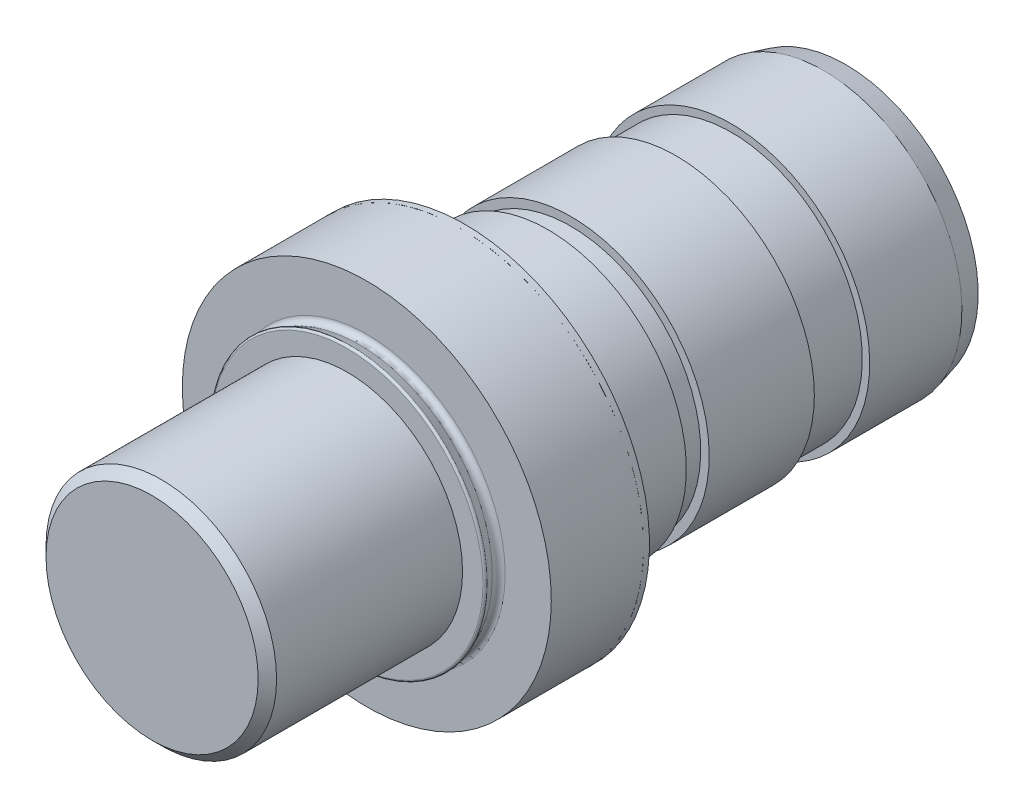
ISO-10303-21;
HEADER;
FILE_DESCRIPTION(('STEP AP214'),'2;1');
FILE_NAME('part.step','',(''),(''),'','','');
FILE_SCHEMA(('AUTOMOTIVE_DESIGN { 1 0 10303 214 1 1 1 1 }'));
ENDSEC;
DATA;
#1=APPLICATION_CONTEXT('core data for automotive mechanical design processes');
#2=APPLICATION_PROTOCOL_DEFINITION('international standard','automotive_design',2000,#1);
#3=PRODUCT_CONTEXT('',#1,'mechanical');
#4=PRODUCT('Part','Part','',(#3));
#5=PRODUCT_RELATED_PRODUCT_CATEGORY('part','',(#4));
#6=PRODUCT_DEFINITION_FORMATION('','',#4);
#7=PRODUCT_DEFINITION_CONTEXT('part definition',#1,'design');
#8=PRODUCT_DEFINITION('design','',#6,#7);
#9=PRODUCT_DEFINITION_SHAPE('','',#8);
#10=(LENGTH_UNIT() NAMED_UNIT(*) SI_UNIT(.MILLI.,.METRE.));
#11=(NAMED_UNIT(*) PLANE_ANGLE_UNIT() SI_UNIT($,.RADIAN.));
#12=(NAMED_UNIT(*) SI_UNIT($,.STERADIAN.) SOLID_ANGLE_UNIT());
#13=UNCERTAINTY_MEASURE_WITH_UNIT(LENGTH_MEASURE(1.E-05),#10,'distance_accuracy_value','');
#14=(GEOMETRIC_REPRESENTATION_CONTEXT(3) GLOBAL_UNCERTAINTY_ASSIGNED_CONTEXT((#13)) GLOBAL_UNIT_ASSIGNED_CONTEXT((#10,
#11,#12)) REPRESENTATION_CONTEXT('',''));
#15=CARTESIAN_POINT('',(0.,0.,0.));
#16=DIRECTION('',(0.,0.,1.));
#17=DIRECTION('',(1.,0.,0.));
#18=AXIS2_PLACEMENT_3D('',#15,#16,#17);
#19=CARTESIAN_POINT('',(9.1186,-9.1186,0.));
#20=DIRECTION('',(0.,0.,-1.));
#21=DIRECTION('',(-1.,0.,0.));
#22=AXIS2_PLACEMENT_3D('',#19,#20,#21);
#23=PLANE('',#22);
#24=CARTESIAN_POINT('',(0.,0.,0.));
#25=DIRECTION('',(0.,0.,-1.));
#26=DIRECTION('',(0.,1.,0.));
#27=AXIS2_PLACEMENT_3D('',#24,#25,#26);
#28=CIRCLE('',#27,9.1186);
#29=CARTESIAN_POINT('',(0.,9.1186,0.));
#30=VERTEX_POINT('',#29);
#31=EDGE_CURVE('E133',#30,#30,#28,.F.);
#32=ORIENTED_EDGE('',*,*,#31,.F.);
#33=EDGE_LOOP('',(#32));
#34=FACE_BOUND('',#33,.T.);
#35=ADVANCED_FACE('F15',(#34),#23,.T.);
#36=CARTESIAN_POINT('',(-7.3025,-8.08428384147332,47.752));
#37=DIRECTION('',(0.,0.,1.));
#38=DIRECTION('',(1.,0.,0.));
#39=AXIS2_PLACEMENT_3D('',#36,#37,#38);
#40=PLANE('',#39);
#41=CARTESIAN_POINT('',(0.,0.,47.752));
#42=DIRECTION('',(0.,0.,1.));
#43=DIRECTION('',(1.,0.,0.));
#44=AXIS2_PLACEMENT_3D('',#41,#42,#43);
#45=CIRCLE('',#44,7.30250000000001);
#46=CARTESIAN_POINT('',(7.30250000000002,0.,47.752));
#47=VERTEX_POINT('',#46);
#48=EDGE_CURVE('E129',#47,#47,#45,.F.);
#49=ORIENTED_EDGE('',*,*,#48,.F.);
#50=EDGE_LOOP('',(#49));
#51=FACE_BOUND('',#50,.T.);
#52=ADVANCED_FACE('F142',(#51),#40,.T.);
#53=CARTESIAN_POINT('',(0.,0.,1.52400000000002));
#54=DIRECTION('',(0.,0.,1.));
#55=DIRECTION('',(0.,-1.,0.));
#56=AXIS2_PLACEMENT_3D('',#53,#54,#55);
#57=CONICAL_SURFACE('',#56,9.525,0.260602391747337);
#58=ORIENTED_EDGE('',*,*,#31,.T.);
#59=EDGE_LOOP('',(#58));
#60=FACE_BOUND('',#59,.T.);
#61=CARTESIAN_POINT('',(0.,0.,1.52400000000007));
#62=DIRECTION('',(0.,0.,1.));
#63=DIRECTION('',(0.,-1.,0.));
#64=AXIS2_PLACEMENT_3D('',#61,#62,#63);
#65=CIRCLE('',#64,9.52500000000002);
#66=CARTESIAN_POINT('',(0.,-9.52500000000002,1.52400000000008));
#67=VERTEX_POINT('',#66);
#68=EDGE_CURVE('E126',#67,#67,#65,.T.);
#69=ORIENTED_EDGE('',*,*,#68,.F.);
#70=EDGE_LOOP('',(#69));
#71=FACE_BOUND('',#70,.T.);
#72=ADVANCED_FACE('F138',(#60,#71),#57,.T.);
#73=CARTESIAN_POINT('',(0.,0.,47.117));
#74=DIRECTION('',(0.,0.,-1.));
#75=DIRECTION('',(-1.,0.,0.));
#76=AXIS2_PLACEMENT_3D('',#73,#74,#75);
#77=CONICAL_SURFACE('',#76,7.93750000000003,0.785398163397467);
#78=ORIENTED_EDGE('',*,*,#48,.T.);
#79=EDGE_LOOP('',(#78));
#80=FACE_BOUND('',#79,.T.);
#81=CARTESIAN_POINT('',(0.,0.,47.117));
#82=DIRECTION('',(0.,0.,-1.));
#83=DIRECTION('',(-1.,0.,0.));
#84=AXIS2_PLACEMENT_3D('',#81,#82,#83);
#85=CIRCLE('',#84,7.9375);
#86=CARTESIAN_POINT('',(-7.9375,0.,47.117));
#87=VERTEX_POINT('',#86);
#88=EDGE_CURVE('E122',#87,#87,#85,.T.);
#89=ORIENTED_EDGE('',*,*,#88,.F.);
#90=EDGE_LOOP('',(#89));
#91=FACE_BOUND('',#90,.T.);
#92=ADVANCED_FACE('F152',(#80,#91),#77,.T.);
#93=CARTESIAN_POINT('',(0.,0.,1.524));
#94=DIRECTION('',(0.,0.,1.));
#95=DIRECTION('',(0.,-1.,0.));
#96=AXIS2_PLACEMENT_3D('',#93,#94,#95);
#97=CYLINDRICAL_SURFACE('',#96,9.52500000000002);
#98=CARTESIAN_POINT('',(0.,0.,7.874));
#99=DIRECTION('',(0.,0.,1.));
#100=DIRECTION('',(0.,-1.,0.));
#101=AXIS2_PLACEMENT_3D('',#98,#99,#100);
#102=CIRCLE('',#101,9.52500000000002);
#103=CARTESIAN_POINT('',(0.,-9.52500000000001,7.87400000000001));
#104=VERTEX_POINT('',#103);
#105=EDGE_CURVE('E118',#104,#104,#102,.T.);
#106=ORIENTED_EDGE('',*,*,#105,.F.);
#107=EDGE_LOOP('',(#106));
#108=FACE_BOUND('',#107,.T.);
#109=ORIENTED_EDGE('',*,*,#68,.T.);
#110=EDGE_LOOP('',(#109));
#111=FACE_BOUND('',#110,.T.);
#112=ADVANCED_FACE('F155',(#108,#111),#97,.T.);
#113=CARTESIAN_POINT('',(0.,0.,47.117));
#114=DIRECTION('',(0.,0.,-1.));
#115=DIRECTION('',(0.,1.,0.));
#116=AXIS2_PLACEMENT_3D('',#113,#114,#115);
#117=CYLINDRICAL_SURFACE('',#116,7.9375);
#118=CARTESIAN_POINT('',(0.,0.,34.3154));
#119=DIRECTION('',(0.,0.,1.));
#120=DIRECTION('',(1.,0.,0.));
#121=AXIS2_PLACEMENT_3D('',#118,#119,#120);
#122=CIRCLE('',#121,7.9375);
#123=CARTESIAN_POINT('',(7.93749999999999,0.,34.3154));
#124=VERTEX_POINT('',#123);
#125=EDGE_CURVE('E115',#124,#124,#122,.F.);
#126=ORIENTED_EDGE('',*,*,#125,.F.);
#127=EDGE_LOOP('',(#126));
#128=FACE_BOUND('',#127,.T.);
#129=ORIENTED_EDGE('',*,*,#88,.T.);
#130=EDGE_LOOP('',(#129));
#131=FACE_BOUND('',#130,.T.);
#132=ADVANCED_FACE('F159',(#128,#131),#117,.T.);
#133=CARTESIAN_POINT('',(-10.5520800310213,-10.5447180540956,7.87400000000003));
#134=DIRECTION('',(0.,0.,1.));
#135=DIRECTION('',(1.,0.,0.));
#136=AXIS2_PLACEMENT_3D('',#133,#134,#135);
#137=PLANE('',#136);
#138=CARTESIAN_POINT('',(0.,0.,7.874));
#139=DIRECTION('',(0.,0.,1.));
#140=DIRECTION('',(0.,-1.,0.));
#141=AXIS2_PLACEMENT_3D('',#138,#139,#140);
#142=CIRCLE('',#141,9.017);
#143=CARTESIAN_POINT('',(0.,-9.01699999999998,7.87400000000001));
#144=VERTEX_POINT('',#143);
#145=EDGE_CURVE('E111',#144,#144,#142,.T.);
#146=ORIENTED_EDGE('',*,*,#145,.F.);
#147=EDGE_LOOP('',(#146));
#148=FACE_BOUND('',#147,.T.);
#149=ORIENTED_EDGE('',*,*,#105,.T.);
#150=EDGE_LOOP('',(#149));
#151=FACE_BOUND('',#150,.T.);
#152=ADVANCED_FACE('F163',(#148,#151),#137,.T.);
#153=CARTESIAN_POINT('',(-9.34213714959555,-10.342278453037,34.3154));
#154=DIRECTION('',(0.,0.,1.));
#155=DIRECTION('',(1.,0.,0.));
#156=AXIS2_PLACEMENT_3D('',#153,#154,#155);
#157=PLANE('',#156);
#158=ORIENTED_EDGE('',*,*,#125,.T.);
#159=EDGE_LOOP('',(#158));
#160=FACE_BOUND('',#159,.T.);
#161=CARTESIAN_POINT('',(0.,0.,34.3154));
#162=DIRECTION('',(0.,0.,1.));
#163=DIRECTION('',(1.,0.,0.));
#164=AXIS2_PLACEMENT_3D('',#161,#162,#163);
#165=CIRCLE('',#164,9.34213714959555);
#166=CARTESIAN_POINT('',(9.34213714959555,0.,34.3154));
#167=VERTEX_POINT('',#166);
#168=EDGE_CURVE('E107',#167,#167,#165,.F.);
#169=ORIENTED_EDGE('',*,*,#168,.F.);
#170=EDGE_LOOP('',(#169));
#171=FACE_BOUND('',#170,.T.);
#172=ADVANCED_FACE('F167',(#160,#171),#157,.T.);
#173=CARTESIAN_POINT('',(0.,0.,11.684));
#174=DIRECTION('',(0.,0.,-1.));
#175=DIRECTION('',(-1.,0.,0.));
#176=AXIS2_PLACEMENT_3D('',#173,#174,#175);
#177=CYLINDRICAL_SURFACE('',#176,9.017);
#178=ORIENTED_EDGE('',*,*,#145,.T.);
#179=EDGE_LOOP('',(#178));
#180=FACE_BOUND('',#179,.T.);
#181=CARTESIAN_POINT('',(0.,0.,11.684));
#182=DIRECTION('',(0.,0.,-1.));
#183=DIRECTION('',(-1.,0.,0.));
#184=AXIS2_PLACEMENT_3D('',#181,#182,#183);
#185=CIRCLE('',#184,9.017);
#186=CARTESIAN_POINT('',(-9.017,0.,11.684));
#187=VERTEX_POINT('',#186);
#188=EDGE_CURVE('E103',#187,#187,#185,.F.);
#189=ORIENTED_EDGE('',*,*,#188,.F.);
#190=EDGE_LOOP('',(#189));
#191=FACE_BOUND('',#190,.T.);
#192=ADVANCED_FACE('F171',(#180,#191),#177,.T.);
#193=CARTESIAN_POINT('',(9.525,-10.5447180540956,11.684));
#194=DIRECTION('',(0.,0.,-1.));
#195=DIRECTION('',(-1.,0.,0.));
#196=AXIS2_PLACEMENT_3D('',#193,#194,#195);
#197=PLANE('',#196);
#198=ORIENTED_EDGE('',*,*,#188,.T.);
#199=EDGE_LOOP('',(#198));
#200=FACE_BOUND('',#199,.T.);
#201=CARTESIAN_POINT('',(0.,0.,11.684));
#202=DIRECTION('',(0.,0.,-1.));
#203=DIRECTION('',(-1.,0.,0.));
#204=AXIS2_PLACEMENT_3D('',#201,#202,#203);
#205=CIRCLE('',#204,9.525);
#206=CARTESIAN_POINT('',(-9.525,0.,11.684));
#207=VERTEX_POINT('',#206);
#208=EDGE_CURVE('E99',#207,#207,#205,.F.);
#209=ORIENTED_EDGE('',*,*,#208,.F.);
#210=EDGE_LOOP('',(#209));
#211=FACE_BOUND('',#210,.T.);
#212=ADVANCED_FACE('F175',(#200,#211),#197,.T.);
#213=CARTESIAN_POINT('',(0.,0.,34.1884));
#214=DIRECTION('',(0.,0.,1.));
#215=DIRECTION('',(1.,0.,0.));
#216=AXIS2_PLACEMENT_3D('',#213,#214,#215);
#217=TOROIDAL_SURFACE('',#216,9.34213714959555,0.127);
#218=ORIENTED_EDGE('',*,*,#168,.T.);
#219=EDGE_LOOP('',(#218));
#220=FACE_BOUND('',#219,.T.);
#221=CARTESIAN_POINT('',(0.,0.,34.1367444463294));
#222=DIRECTION('',(0.,0.,1.));
#223=DIRECTION('',(1.,0.,0.));
#224=AXIS2_PLACEMENT_3D('',#221,#222,#223);
#225=CIRCLE('',#224,9.45815742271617);
#226=CARTESIAN_POINT('',(9.45815742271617,0.,34.1367444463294));
#227=VERTEX_POINT('',#226);
#228=EDGE_CURVE('E96',#227,#227,#225,.F.);
#229=ORIENTED_EDGE('',*,*,#228,.F.);
#230=EDGE_LOOP('',(#229));
#231=FACE_BOUND('',#230,.T.);
#232=ADVANCED_FACE('F179',(#220,#231),#217,.T.);
#233=CARTESIAN_POINT('',(0.,0.,11.684));
#234=DIRECTION('',(0.,0.,1.));
#235=DIRECTION('',(0.,-1.,0.));
#236=AXIS2_PLACEMENT_3D('',#233,#234,#235);
#237=CYLINDRICAL_SURFACE('',#236,9.525);
#238=CARTESIAN_POINT('',(0.,0.,18.923));
#239=DIRECTION('',(0.,0.,1.));
#240=DIRECTION('',(0.,-1.,0.));
#241=AXIS2_PLACEMENT_3D('',#238,#239,#240);
#242=CIRCLE('',#241,9.525);
#243=CARTESIAN_POINT('',(0.,-9.52499999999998,18.923));
#244=VERTEX_POINT('',#243);
#245=EDGE_CURVE('E93',#244,#244,#242,.T.);
#246=ORIENTED_EDGE('',*,*,#245,.F.);
#247=EDGE_LOOP('',(#246));
#248=FACE_BOUND('',#247,.T.);
#249=ORIENTED_EDGE('',*,*,#208,.T.);
#250=EDGE_LOOP('',(#249));
#251=FACE_BOUND('',#250,.T.);
#252=ADVANCED_FACE('F183',(#248,#251),#237,.T.);
#253=CARTESIAN_POINT('',(0.,0.,34.1367444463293));
#254=DIRECTION('',(0.,0.,1.));
#255=DIRECTION('',(1.,0.,0.));
#256=AXIS2_PLACEMENT_3D('',#253,#254,#255);
#257=CONICAL_SURFACE('',#256,9.45815742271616,0.418879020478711);
#258=ORIENTED_EDGE('',*,*,#228,.T.);
#259=EDGE_LOOP('',(#258));
#260=FACE_BOUND('',#259,.T.);
#261=CARTESIAN_POINT('',(0.,0.,33.5051666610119));
#262=DIRECTION('',(0.,0.,1.));
#263=DIRECTION('',(1.,0.,0.));
#264=AXIS2_PLACEMENT_3D('',#261,#262,#263);
#265=CIRCLE('',#264,9.17696087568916);
#266=CARTESIAN_POINT('',(9.17696087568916,0.,33.5051666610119));
#267=VERTEX_POINT('',#266);
#268=EDGE_CURVE('E90',#267,#267,#265,.F.);
#269=ORIENTED_EDGE('',*,*,#268,.F.);
#270=EDGE_LOOP('',(#269));
#271=FACE_BOUND('',#270,.T.);
#272=ADVANCED_FACE('F187',(#260,#271),#257,.T.);
#273=CARTESIAN_POINT('',(-10.5520800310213,-10.5447180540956,18.923));
#274=DIRECTION('',(0.,0.,1.));
#275=DIRECTION('',(1.,0.,0.));
#276=AXIS2_PLACEMENT_3D('',#273,#274,#275);
#277=PLANE('',#276);
#278=CARTESIAN_POINT('',(0.,0.,18.923));
#279=DIRECTION('',(0.,0.,1.));
#280=DIRECTION('',(0.,-1.,0.));
#281=AXIS2_PLACEMENT_3D('',#278,#279,#280);
#282=CIRCLE('',#281,8.9408);
#283=CARTESIAN_POINT('',(0.,-8.94079999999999,18.923));
#284=VERTEX_POINT('',#283);
#285=EDGE_CURVE('E87',#284,#284,#282,.T.);
#286=ORIENTED_EDGE('',*,*,#285,.F.);
#287=EDGE_LOOP('',(#286));
#288=FACE_BOUND('',#287,.T.);
#289=ORIENTED_EDGE('',*,*,#245,.T.);
#290=EDGE_LOOP('',(#289));
#291=FACE_BOUND('',#290,.T.);
#292=ADVANCED_FACE('F191',(#288,#291),#277,.T.);
#293=CARTESIAN_POINT('',(0.,0.,20.4978));
#294=DIRECTION('',(0.,0.,-1.));
#295=DIRECTION('',(0.,1.,0.));
#296=AXIS2_PLACEMENT_3D('',#293,#294,#295);
#297=CYLINDRICAL_SURFACE('',#296,8.9408);
#298=ORIENTED_EDGE('',*,*,#285,.T.);
#299=EDGE_LOOP('',(#298));
#300=FACE_BOUND('',#299,.T.);
#301=CARTESIAN_POINT('',(0.,0.,20.4978));
#302=DIRECTION('',(0.,0.,-1.));
#303=DIRECTION('',(-1.,0.,0.));
#304=AXIS2_PLACEMENT_3D('',#301,#302,#303);
#305=CIRCLE('',#304,8.9408);
#306=CARTESIAN_POINT('',(-8.9408,0.,20.4978));
#307=VERTEX_POINT('',#306);
#308=EDGE_CURVE('E84',#307,#307,#305,.F.);
#309=ORIENTED_EDGE('',*,*,#308,.F.);
#310=EDGE_LOOP('',(#309));
#311=FACE_BOUND('',#310,.T.);
#312=ADVANCED_FACE('F195',(#300,#311),#297,.T.);
#313=CARTESIAN_POINT('',(0.,0.,33.3502));
#314=DIRECTION('',(0.,0.,1.));
#315=DIRECTION('',(1.,0.,0.));
#316=AXIS2_PLACEMENT_3D('',#313,#314,#315);
#317=TOROIDAL_SURFACE('',#316,9.525021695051,0.381);
#318=ORIENTED_EDGE('',*,*,#268,.T.);
#319=EDGE_LOOP('',(#318));
#320=FACE_BOUND('',#319,.T.);
#321=CARTESIAN_POINT('',(0.,0.,32.9692));
#322=DIRECTION('',(0.,0.,1.));
#323=DIRECTION('',(1.,0.,0.));
#324=AXIS2_PLACEMENT_3D('',#321,#322,#323);
#325=CIRCLE('',#324,9.525021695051);
#326=CARTESIAN_POINT('',(9.525021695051,0.,32.9692));
#327=VERTEX_POINT('',#326);
#328=EDGE_CURVE('E79',#327,#327,#325,.F.);
#329=ORIENTED_EDGE('',*,*,#328,.F.);
#330=EDGE_LOOP('',(#329));
#331=FACE_BOUND('',#330,.T.);
#332=ADVANCED_FACE('F199',(#320,#331),#317,.F.);
#333=CARTESIAN_POINT('',(9.525,-10.5447180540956,20.4978));
#334=DIRECTION('',(0.,0.,-1.));
#335=DIRECTION('',(-1.,0.,0.));
#336=AXIS2_PLACEMENT_3D('',#333,#334,#335);
#337=PLANE('',#336);
#338=ORIENTED_EDGE('',*,*,#308,.T.);
#339=EDGE_LOOP('',(#338));
#340=FACE_BOUND('',#339,.T.);
#341=CARTESIAN_POINT('',(0.,0.,20.4978));
#342=DIRECTION('',(0.,0.,-1.));
#343=DIRECTION('',(-1.,0.,0.));
#344=AXIS2_PLACEMENT_3D('',#341,#342,#343);
#345=CIRCLE('',#344,9.525);
#346=CARTESIAN_POINT('',(-9.525,0.,20.4978));
#347=VERTEX_POINT('',#346);
#348=EDGE_CURVE('E74',#347,#347,#345,.F.);
#349=ORIENTED_EDGE('',*,*,#348,.F.);
#350=EDGE_LOOP('',(#349));
#351=FACE_BOUND('',#350,.T.);
#352=ADVANCED_FACE('F203',(#340,#351),#337,.T.);
#353=CARTESIAN_POINT('',(-12.7,-12.7,32.9692));
#354=DIRECTION('',(0.,0.,1.));
#355=DIRECTION('',(1.,0.,0.));
#356=AXIS2_PLACEMENT_3D('',#353,#354,#355);
#357=PLANE('',#356);
#358=ORIENTED_EDGE('',*,*,#328,.T.);
#359=EDGE_LOOP('',(#358));
#360=FACE_BOUND('',#359,.T.);
#361=CARTESIAN_POINT('',(0.,0.,32.9692));
#362=DIRECTION('',(0.,0.,1.));
#363=DIRECTION('',(1.,0.,0.));
#364=AXIS2_PLACEMENT_3D('',#361,#362,#363);
#365=CIRCLE('',#364,12.7);
#366=CARTESIAN_POINT('',(12.7,0.,32.9692));
#367=VERTEX_POINT('',#366);
#368=EDGE_CURVE('E71',#367,#367,#365,.F.);
#369=ORIENTED_EDGE('',*,*,#368,.F.);
#370=EDGE_LOOP('',(#369));
#371=FACE_BOUND('',#370,.T.);
#372=ADVANCED_FACE('F207',(#360,#371),#357,.T.);
#373=CARTESIAN_POINT('',(0.,0.,20.4978));
#374=DIRECTION('',(0.,0.,1.));
#375=DIRECTION('',(1.,0.,0.));
#376=AXIS2_PLACEMENT_3D('',#373,#374,#375);
#377=CYLINDRICAL_SURFACE('',#376,9.525);
#378=ORIENTED_EDGE('',*,*,#348,.T.);
#379=EDGE_LOOP('',(#378));
#380=FACE_BOUND('',#379,.T.);
#381=CARTESIAN_POINT('',(0.,0.,26.6192));
#382=DIRECTION('',(0.,0.,-1.));
#383=DIRECTION('',(-1.,0.,0.));
#384=AXIS2_PLACEMENT_3D('',#381,#382,#383);
#385=CIRCLE('',#384,9.525);
#386=CARTESIAN_POINT('',(-9.525,0.,26.6192));
#387=VERTEX_POINT('',#386);
#388=EDGE_CURVE('E36',#387,#387,#385,.F.);
#389=ORIENTED_EDGE('',*,*,#388,.F.);
#390=EDGE_LOOP('',(#389));
#391=FACE_BOUND('',#390,.T.);
#392=ADVANCED_FACE('F67',(#380,#391),#377,.T.);
#393=CARTESIAN_POINT('',(12.7,-12.7,26.6192));
#394=DIRECTION('',(0.,0.,-1.));
#395=DIRECTION('',(-1.,0.,0.));
#396=AXIS2_PLACEMENT_3D('',#393,#394,#395);
#397=PLANE('',#396);
#398=ORIENTED_EDGE('',*,*,#388,.T.);
#399=EDGE_LOOP('',(#398));
#400=FACE_BOUND('',#399,.T.);
#401=CARTESIAN_POINT('',(12.7,0.,26.6192));
#402=CARTESIAN_POINT('',(12.7000141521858,0.211419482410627,26.6192));
#403=CARTESIAN_POINT('',(12.6950749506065,0.422854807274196,26.6192));
#404=CARTESIAN_POINT('',(12.6751203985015,0.843046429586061,26.6192));
#405=CARTESIAN_POINT('',(12.6602101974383,1.05180774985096,26.6192));
#406=CARTESIAN_POINT('',(12.620317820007,1.46665555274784,26.6192));
#407=CARTESIAN_POINT('',(12.5954186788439,1.67274997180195,26.6192));
#408=CARTESIAN_POINT('',(12.5355760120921,2.08225891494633,26.6192));
#409=CARTESIAN_POINT('',(12.5006914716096,2.28568204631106,26.6192));
#410=CARTESIAN_POINT('',(12.4209015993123,2.68984882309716,26.6192));
#411=CARTESIAN_POINT('',(12.3760301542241,2.89059915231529,26.6192));
#412=CARTESIAN_POINT('',(12.2762922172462,3.28942246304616,26.6192));
#413=CARTESIAN_POINT('',(12.2214341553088,3.48749755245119,26.6192));
#414=CARTESIAN_POINT('',(12.1017491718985,3.88097583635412,26.6192));
#415=CARTESIAN_POINT('',(12.0369056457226,4.07637397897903,26.6192));
#416=CARTESIAN_POINT('',(11.8972725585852,4.46450474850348,26.6192));
#417=CARTESIAN_POINT('',(11.8224425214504,4.65722280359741,26.6192));
#418=CARTESIAN_POINT('',(11.6628682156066,5.04000794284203,26.6192));
#419=CARTESIAN_POINT('',(11.5780615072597,5.23004898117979,26.6192));
#420=CARTESIAN_POINT('',(11.3985242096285,5.60747445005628,26.6192));
#421=CARTESIAN_POINT('',(11.303711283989,5.79481965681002,26.6192));
#422=CARTESIAN_POINT('',(11.1044836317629,6.16658685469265,26.6192));
#423=CARTESIAN_POINT('',(10.9999874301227,6.35096514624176,26.6192));
#424=CARTESIAN_POINT('',(10.7829418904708,6.71358416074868,26.6192));
#425=CARTESIAN_POINT('',(10.6704386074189,6.89185243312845,26.6192));
#426=CARTESIAN_POINT('',(10.438124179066,7.24097258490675,26.6192));
#427=CARTESIAN_POINT('',(10.3183984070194,7.41188121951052,26.6192));
#428=CARTESIAN_POINT('',(10.0715619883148,7.74634180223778,26.6192));
#429=CARTESIAN_POINT('',(9.94451229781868,7.90993869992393,26.6192));
#430=CARTESIAN_POINT('',(9.68306327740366,8.22979494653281,26.6192));
#431=CARTESIAN_POINT('',(9.54870372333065,8.38608679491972,26.6192));
#432=CARTESIAN_POINT('',(9.27265272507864,8.69134360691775,26.6192));
#433=CARTESIAN_POINT('',(9.13098055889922,8.84032599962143,26.6192));
#434=CARTESIAN_POINT('',(8.84032592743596,9.13098065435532,26.6192));
#435=CARTESIAN_POINT('',(8.69134345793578,9.2726529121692,26.6192));
#436=CARTESIAN_POINT('',(8.38608654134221,9.54870402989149,26.6192));
#437=CARTESIAN_POINT('',(8.22979466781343,9.68306361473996,26.6192));
#438=CARTESIAN_POINT('',(7.9099384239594,9.9445126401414,26.6192));
#439=CARTESIAN_POINT('',(7.74634155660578,10.0715623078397,26.6192));
#440=CARTESIAN_POINT('',(7.41188106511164,10.3183985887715,26.6192));
#441=CARTESIAN_POINT('',(7.24097249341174,10.4381242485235,26.6192));
#442=CARTESIAN_POINT('',(6.89185178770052,10.6704390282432,26.6192));
#443=CARTESIAN_POINT('',(6.71358287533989,10.7829427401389,26.6192));
#444=CARTESIAN_POINT('',(6.35096383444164,10.9999882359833,26.6192));
#445=CARTESIAN_POINT('',(6.16658619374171,11.1044840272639,26.6192));
#446=CARTESIAN_POINT('',(5.79481925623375,11.3037114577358,26.6192));
#447=CARTESIAN_POINT('',(5.60747363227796,11.3985245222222,26.6192));
#448=CARTESIAN_POINT('',(5.23004814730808,11.578061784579,26.6192));
#449=CARTESIAN_POINT('',(5.04000752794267,11.6628683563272,26.6192));
#450=CARTESIAN_POINT('',(4.65722285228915,11.8224425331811,26.6192));
#451=CARTESIAN_POINT('',(4.46450483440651,11.8972725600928,26.6192));
#452=CARTESIAN_POINT('',(4.07637413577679,12.0369056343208,26.6192));
#453=CARTESIAN_POINT('',(3.88097602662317,12.1017491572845,26.6192));
#454=CARTESIAN_POINT('',(3.48749778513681,12.2214341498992,26.6192));
#455=CARTESIAN_POINT('',(3.28942270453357,12.276292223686,26.6192));
#456=CARTESIAN_POINT('',(2.89059944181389,12.3760301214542,26.6192));
#457=CARTESIAN_POINT('',(2.68984915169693,12.4209015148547,26.6192));
#458=CARTESIAN_POINT('',(2.28568228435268,12.5006915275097,26.6192));
#459=CARTESIAN_POINT('',(2.08225902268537,12.535576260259,26.6192));
#460=CARTESIAN_POINT('',(1.67275039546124,12.5954184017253,26.6192));
#461=CARTESIAN_POINT('',(1.46665642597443,12.6203168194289,26.6192));
#462=CARTESIAN_POINT('',(1.0518072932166,12.6602111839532,26.6192));
#463=CARTESIAN_POINT('',(0.843044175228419,12.6751241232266,26.6192));
#464=CARTESIAN_POINT('',(0.422857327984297,12.6950711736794,26.6192));
#465=CARTESIAN_POINT('',(0.211428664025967,12.6999999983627,26.6192));
#466=CARTESIAN_POINT('',(-0.211428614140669,12.7000000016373,26.6192));
#467=CARTESIAN_POINT('',(-0.422857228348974,12.6950711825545,26.6192));
#468=CARTESIAN_POINT('',(-0.843043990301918,12.6751241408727,26.6192));
#469=CARTESIAN_POINT('',(-1.05180707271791,12.660211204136,26.6192));
#470=CARTESIAN_POINT('',(-1.46665614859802,12.6203168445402,26.6192));
#471=CARTESIAN_POINT('',(-1.67275009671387,12.5954184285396,26.6192));
#472=CARTESIAN_POINT('',(-2.08225869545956,12.5355762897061,26.6192));
#473=CARTESIAN_POINT('',(-2.28568194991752,12.5006915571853,26.6192));
#474=CARTESIAN_POINT('',(-2.68984881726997,12.4209015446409,26.6192));
#475=CARTESIAN_POINT('',(-2.89059911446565,12.3760301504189,26.6192));
#476=CARTESIAN_POINT('',(-3.2894224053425,12.2762922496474,26.6192));
#477=CARTESIAN_POINT('',(-3.48749750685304,12.2214341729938,26.6192));
#478=CARTESIAN_POINT('',(-3.88097580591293,12.1017491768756,26.6192));
#479=CARTESIAN_POINT('',(-4.07637395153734,12.0369056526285,26.6192));
#480=CARTESIAN_POINT('',(-4.46450473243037,11.8972725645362,26.6192));
#481=CARTESIAN_POINT('',(-4.65722279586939,11.822442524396,26.6192));
#482=CARTESIAN_POINT('',(-5.04000793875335,11.662868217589,26.6192));
#483=CARTESIAN_POINT('',(-5.23004897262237,11.5780615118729,26.6192));
#484=CARTESIAN_POINT('',(-5.60747444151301,11.3985242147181,26.6192));
#485=CARTESIAN_POINT('',(-5.79481965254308,11.3037112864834,26.6192));
#486=CARTESIAN_POINT('',(-6.1665868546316,11.1044836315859,26.6192));
#487=CARTESIAN_POINT('',(-6.35096514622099,10.9999874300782,26.6192));
#488=CARTESIAN_POINT('',(-6.71358416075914,10.7829418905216,26.6192));
#489=CARTESIAN_POINT('',(-6.89185243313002,10.6704386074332,26.6192));
#490=CARTESIAN_POINT('',(-7.2409725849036,10.4381241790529,26.6192));
#491=CARTESIAN_POINT('',(-7.41188121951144,10.3183984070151,26.6192));
#492=CARTESIAN_POINT('',(-7.74634180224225,10.0715619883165,26.6192));
#493=CARTESIAN_POINT('',(-7.90993869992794,9.9445122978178,26.6192));
#494=CARTESIAN_POINT('',(-8.22979494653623,9.68306327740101,26.6192));
#495=CARTESIAN_POINT('',(-8.38608679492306,9.54870372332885,26.6192));
#496=CARTESIAN_POINT('',(-8.69134360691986,9.27265272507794,26.6192));
#497=CARTESIAN_POINT('',(-8.84032599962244,9.1309805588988,26.6192));
#498=CARTESIAN_POINT('',(-9.13098065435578,8.84032592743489,26.6192));
#499=CARTESIAN_POINT('',(-9.27265291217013,8.6913434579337,26.6192));
#500=CARTESIAN_POINT('',(-9.54870402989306,8.3860865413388,26.6192));
#501=CARTESIAN_POINT('',(-9.68306361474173,8.2297946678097,26.6192));
#502=CARTESIAN_POINT('',(-9.94451264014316,7.90993842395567,26.6192));
#503=CARTESIAN_POINT('',(-10.0715623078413,7.74634155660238,26.6192));
#504=CARTESIAN_POINT('',(-10.3183985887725,7.41188106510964,26.6192));
#505=CARTESIAN_POINT('',(-10.438124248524,7.2409724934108,26.6192));
#506=CARTESIAN_POINT('',(-10.6704390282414,6.89185178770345,26.6192));
#507=CARTESIAN_POINT('',(-10.7829427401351,6.71358287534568,26.6192));
#508=CARTESIAN_POINT('',(-10.9999882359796,6.35096383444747,26.6192));
#509=CARTESIAN_POINT('',(-11.1044840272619,6.16658619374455,26.6192));
#510=CARTESIAN_POINT('',(-11.3037114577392,5.79481925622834,26.6192));
#511=CARTESIAN_POINT('',(-11.3985245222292,5.6074736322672,26.6192));
#512=CARTESIAN_POINT('',(-11.5780617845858,5.23004814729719,26.6192));
#513=CARTESIAN_POINT('',(-11.6628683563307,5.04000752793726,26.6192));
#514=CARTESIAN_POINT('',(-11.8224425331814,4.65722285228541,26.6192));
#515=CARTESIAN_POINT('',(-11.8972725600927,4.46450483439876,26.6192));
#516=CARTESIAN_POINT('',(-12.0369056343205,4.07637413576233,26.6192));
#517=CARTESIAN_POINT('',(-12.1017491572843,3.880976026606,26.6192));
#518=CARTESIAN_POINT('',(-12.221434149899,3.48749778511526,26.6192));
#519=CARTESIAN_POINT('',(-12.2762922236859,3.28942270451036,26.6192));
#520=CARTESIAN_POINT('',(-12.376030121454,2.89059944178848,26.6192));
#521=CARTESIAN_POINT('',(-12.4209015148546,2.68984915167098,26.6192));
#522=CARTESIAN_POINT('',(-12.5006915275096,2.28568228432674,26.6192));
#523=CARTESIAN_POINT('',(-12.5355762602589,2.08225902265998,26.6192));
#524=CARTESIAN_POINT('',(-12.5954184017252,1.67275039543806,26.6192));
#525=CARTESIAN_POINT('',(-12.6203168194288,1.46665642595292,26.6192));
#526=CARTESIAN_POINT('',(-12.6602111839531,1.05180729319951,26.6192));
#527=CARTESIAN_POINT('',(-12.6751241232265,0.843044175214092,26.6192));
#528=CARTESIAN_POINT('',(-12.6950711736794,0.422857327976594,26.6192));
#529=CARTESIAN_POINT('',(-12.6999999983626,0.211428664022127,26.6192));
#530=CARTESIAN_POINT('',(-12.7000000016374,-0.21142861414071,26.6192));
#531=CARTESIAN_POINT('',(-12.6950711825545,-0.422857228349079,26.6192));
#532=CARTESIAN_POINT('',(-12.6751241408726,-0.843043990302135,26.6192));
#533=CARTESIAN_POINT('',(-12.660211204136,-1.05180707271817,26.6192));
#534=CARTESIAN_POINT('',(-12.6203168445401,-1.46665614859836,26.6192));
#535=CARTESIAN_POINT('',(-12.5954184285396,-1.67275009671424,26.6192));
#536=CARTESIAN_POINT('',(-12.535576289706,-2.08225869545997,26.6192));
#537=CARTESIAN_POINT('',(-12.5006915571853,-2.28568194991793,26.6192));
#538=CARTESIAN_POINT('',(-12.4209015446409,-2.68984881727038,26.6192));
#539=CARTESIAN_POINT('',(-12.3760301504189,-2.89059911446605,26.6192));
#540=CARTESIAN_POINT('',(-12.2762922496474,-3.28942240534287,26.6192));
#541=CARTESIAN_POINT('',(-12.2214341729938,-3.48749750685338,26.6192));
#542=CARTESIAN_POINT('',(-12.1017491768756,-3.88097580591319,26.6192));
#543=CARTESIAN_POINT('',(-12.0369056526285,-4.07637395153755,26.6192));
#544=CARTESIAN_POINT('',(-11.8972725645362,-4.46450473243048,26.6192));
#545=CARTESIAN_POINT('',(-11.822442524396,-4.65722279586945,26.6192));
#546=CARTESIAN_POINT('',(-11.6628682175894,-5.04000793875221,26.6192));
#547=CARTESIAN_POINT('',(-11.5780615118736,-5.23004897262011,26.6192));
#548=CARTESIAN_POINT('',(-11.398524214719,-5.6074744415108,26.6192));
#549=CARTESIAN_POINT('',(-11.3037112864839,-5.794819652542,26.6192));
#550=CARTESIAN_POINT('',(-11.1044836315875,-6.16658685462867,26.6192));
#551=CARTESIAN_POINT('',(-10.9999874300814,-6.35096514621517,26.6192));
#552=CARTESIAN_POINT('',(-10.782941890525,-6.71358416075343,26.6192));
#553=CARTESIAN_POINT('',(-10.6704386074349,-6.89185243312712,26.6192));
#554=CARTESIAN_POINT('',(-10.4381241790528,-7.24097258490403,26.6192));
#555=CARTESIAN_POINT('',(-10.3183984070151,-7.41188121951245,26.6192));
#556=CARTESIAN_POINT('',(-10.0715619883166,-7.74634180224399,26.6192));
#557=CARTESIAN_POINT('',(-9.94451229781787,-7.90993869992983,26.6192));
#558=CARTESIAN_POINT('',(-9.68306327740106,-8.22979494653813,26.6192));
#559=CARTESIAN_POINT('',(-9.54870372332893,-8.38608679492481,26.6192));
#560=CARTESIAN_POINT('',(-9.27265272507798,-8.69134360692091,26.6192));
#561=CARTESIAN_POINT('',(-9.13098055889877,-8.84032599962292,26.6192));
#562=CARTESIAN_POINT('',(-8.84032592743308,-9.13098065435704,26.6192));
#563=CARTESIAN_POINT('',(-8.69134345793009,-9.27265291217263,26.6192));
#564=CARTESIAN_POINT('',(-8.38608654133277,-9.5487040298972,26.6192));
#565=CARTESIAN_POINT('',(-8.22979466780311,-9.68306361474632,26.6192));
#566=CARTESIAN_POINT('',(-7.90993842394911,-9.9445126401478,26.6192));
#567=CARTESIAN_POINT('',(-7.74634155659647,-10.0715623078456,26.6192));
#568=CARTESIAN_POINT('',(-7.411881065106,-10.318398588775,26.6192));
#569=CARTESIAN_POINT('',(-7.24097249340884,-10.438124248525,26.6192));
#570=CARTESIAN_POINT('',(-6.89185178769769,-10.6704390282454,26.6192));
#571=CARTESIAN_POINT('',(-6.7135828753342,-10.7829427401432,26.6192));
#572=CARTESIAN_POINT('',(-6.35096383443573,-10.9999882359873,26.6192));
#573=CARTESIAN_POINT('',(-6.16658619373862,-11.1044840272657,26.6192));
#574=CARTESIAN_POINT('',(-5.79481925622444,-11.3037114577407,26.6192));
#575=CARTESIAN_POINT('',(-5.60747363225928,-11.3985245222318,26.6192));
#576=CARTESIAN_POINT('',(-5.23004814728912,-11.5780617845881,26.6192));
#577=CARTESIAN_POINT('',(-5.04000752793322,-11.6628683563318,26.6192));
#578=CARTESIAN_POINT('',(-4.65722285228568,-11.8224425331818,26.6192));
#579=CARTESIAN_POINT('',(-4.46450483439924,-11.8972725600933,26.6192));
#580=CARTESIAN_POINT('',(-4.07637413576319,-12.0369056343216,26.6192));
#581=CARTESIAN_POINT('',(-3.88097602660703,-12.1017491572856,26.6192));
#582=CARTESIAN_POINT('',(-3.48749778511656,-12.2214341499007,26.6192));
#583=CARTESIAN_POINT('',(-3.28942270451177,-12.2762922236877,26.6192));
#584=CARTESIAN_POINT('',(-2.89059944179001,-12.376030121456,26.6192));
#585=CARTESIAN_POINT('',(-2.68984915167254,-12.4209015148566,26.6192));
#586=CARTESIAN_POINT('',(-2.2856822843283,-12.5006915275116,26.6192));
#587=CARTESIAN_POINT('',(-2.08225902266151,-12.5355762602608,26.6192));
#588=CARTESIAN_POINT('',(-1.67275039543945,-12.595418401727,26.6192));
#589=CARTESIAN_POINT('',(-1.46665642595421,-12.6203168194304,26.6192));
#590=CARTESIAN_POINT('',(-1.05180729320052,-12.6602111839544,26.6192));
#591=CARTESIAN_POINT('',(-0.843044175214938,-12.6751241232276,26.6192));
#592=CARTESIAN_POINT('',(-0.422857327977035,-12.69507117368,26.6192));
#593=CARTESIAN_POINT('',(-0.211428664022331,-12.6999999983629,26.6192));
#594=CARTESIAN_POINT('',(0.21142861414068,-12.700000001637,26.6192));
#595=CARTESIAN_POINT('',(0.422857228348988,-12.6950711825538,26.6192));
#596=CARTESIAN_POINT('',(0.843043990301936,-12.6751241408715,26.6192));
#597=CARTESIAN_POINT('',(1.05180707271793,-12.6602112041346,26.6192));
#598=CARTESIAN_POINT('',(1.46665614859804,-12.6203168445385,26.6192));
#599=CARTESIAN_POINT('',(1.6727500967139,-12.5954184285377,26.6192));
#600=CARTESIAN_POINT('',(2.08225869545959,-12.5355762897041,26.6192));
#601=CARTESIAN_POINT('',(2.28568194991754,-12.5006915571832,26.6192));
#602=CARTESIAN_POINT('',(2.68984881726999,-12.4209015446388,26.6192));
#603=CARTESIAN_POINT('',(2.89059911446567,-12.3760301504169,26.6192));
#604=CARTESIAN_POINT('',(3.28942240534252,-12.2762922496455,26.6192));
#605=CARTESIAN_POINT('',(3.48749750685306,-12.2214341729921,26.6192));
#606=CARTESIAN_POINT('',(3.88097580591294,-12.1017491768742,26.6192));
#607=CARTESIAN_POINT('',(4.07637395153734,-12.0369056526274,26.6192));
#608=CARTESIAN_POINT('',(4.46450473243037,-11.8972725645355,26.6192));
#609=CARTESIAN_POINT('',(4.6572227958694,-11.8224425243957,26.6192));
#610=CARTESIAN_POINT('',(5.04000793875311,-11.6628682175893,26.6192));
#611=CARTESIAN_POINT('',(5.23004897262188,-11.5780615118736,26.6192));
#612=CARTESIAN_POINT('',(5.60747444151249,-11.3985242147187,26.6192));
#613=CARTESIAN_POINT('',(5.79481965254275,-11.3037112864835,26.6192));
#614=CARTESIAN_POINT('',(6.16658685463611,-11.1044836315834,26.6192));
#615=CARTESIAN_POINT('',(6.35096514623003,-10.9999874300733,26.6192));
#616=CARTESIAN_POINT('',(6.71358416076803,-10.7829418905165,26.6192));
#617=CARTESIAN_POINT('',(6.89185243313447,-10.6704386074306,26.6192));
#618=CARTESIAN_POINT('',(7.24097258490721,-10.4381241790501,26.6192));
#619=CARTESIAN_POINT('',(7.41188121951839,-10.3183984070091,26.6192));
#620=CARTESIAN_POINT('',(7.7463418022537,-10.0715619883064,26.6192));
#621=CARTESIAN_POINT('',(7.90993869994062,-9.94451229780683,26.6192));
#622=CARTESIAN_POINT('',(8.22979494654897,-9.68306327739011,26.6192));
#623=CARTESIAN_POINT('',(8.3860867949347,-9.54870372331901,26.6192));
#624=CARTESIAN_POINT('',(8.6913436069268,-9.27265272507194,26.6192));
#625=CARTESIAN_POINT('',(8.84032599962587,-9.13098055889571,26.6192));
#626=CARTESIAN_POINT('',(9.13098065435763,-8.84032592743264,26.6192));
#627=CARTESIAN_POINT('',(9.27265291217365,-8.69134345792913,26.6192));
#628=CARTESIAN_POINT('',(9.5487040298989,-8.38608654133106,26.6192));
#629=CARTESIAN_POINT('',(9.68306361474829,-8.22979466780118,26.6192));
#630=CARTESIAN_POINT('',(9.94451264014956,-7.90993842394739,26.6192));
#631=CARTESIAN_POINT('',(10.0715623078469,-7.74634155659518,26.6192));
#632=CARTESIAN_POINT('',(10.3183985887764,-7.41188106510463,26.6192));
#633=CARTESIAN_POINT('',(10.4381242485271,-7.24097249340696,26.6192));
#634=CARTESIAN_POINT('',(10.6704390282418,-6.89185178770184,26.6192));
#635=CARTESIAN_POINT('',(10.7829427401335,-6.71358287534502,26.6192));
#636=CARTESIAN_POINT('',(10.9999882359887,-6.35096383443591,26.6192));
#637=CARTESIAN_POINT('',(11.1044840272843,-6.16658619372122,26.6192));
#638=CARTESIAN_POINT('',(11.3037114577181,-5.79481925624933,26.6192));
#639=CARTESIAN_POINT('',(11.398524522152,-5.60747363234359,26.6192));
#640=CARTESIAN_POINT('',(11.578061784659,-5.23004814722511,26.6192));
#641=CARTESIAN_POINT('',(11.6628683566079,-5.04000752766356,26.6192));
#642=CARTESIAN_POINT('',(11.8224425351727,-4.65722284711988,26.6192));
#643=CARTESIAN_POINT('',(11.8972725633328,-4.46450482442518,26.6192));
#644=CARTESIAN_POINT('',(12.0369056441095,-4.07637411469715,26.6192));
#645=CARTESIAN_POINT('',(12.1017491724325,-3.88097599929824,26.6192));
#646=CARTESIAN_POINT('',(12.2214341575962,-3.48749775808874,26.6192));
#647=CARTESIAN_POINT('',(12.2762922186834,-3.28942268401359,26.6192));
#648=CARTESIAN_POINT('',(12.3760301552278,-2.89059939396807,26.6192));
#649=CARTESIAN_POINT('',(12.4209016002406,-2.68984906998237,26.6192));
#650=CARTESIAN_POINT('',(12.5006914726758,-2.28568229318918,26.6192));
#651=CARTESIAN_POINT('',(12.5355760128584,-2.08225915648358,26.6192));
#652=CARTESIAN_POINT('',(12.5954186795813,-1.67275019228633,26.6192));
#653=CARTESIAN_POINT('',(12.6203178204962,-1.46665575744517,26.6192));
#654=CARTESIAN_POINT('',(12.6602101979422,-1.05180791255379,26.6192));
#655=CARTESIAN_POINT('',(12.6751203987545,-0.843046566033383,26.6192));
#656=CARTESIAN_POINT('',(12.6950749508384,-0.422854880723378,26.6192));
#657=CARTESIAN_POINT('',(12.7000141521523,-0.211419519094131,26.6192));
#658=CARTESIAN_POINT('',(12.7,0.,26.6192));
#659=B_SPLINE_CURVE_WITH_KNOTS('',3,(#401,#402,#403,#404,#405,#406,#407,#408,#409,#410,#411,
#412,#413,#414,#415,#416,#417,#418,#419,#420,#421,#422,#423,#424,#425,#426,#427,#428,#429,#430,
#431,#432,#433,#434,#435,#436,#437,#438,#439,#440,#441,#442,#443,#444,#445,#446,#447,#448,#449,
#450,#451,#452,#453,#454,#455,#456,#457,#458,#459,#460,#461,#462,#463,#464,#465,#466,#467,#468,
#469,#470,#471,#472,#473,#474,#475,#476,#477,#478,#479,#480,#481,#482,#483,#484,#485,#486,#487,
#488,#489,#490,#491,#492,#493,#494,#495,#496,#497,#498,#499,#500,#501,#502,#503,#504,#505,#506,
#507,#508,#509,#510,#511,#512,#513,#514,#515,#516,#517,#518,#519,#520,#521,#522,#523,#524,#525,
#526,#527,#528,#529,#530,#531,#532,#533,#534,#535,#536,#537,#538,#539,#540,#541,#542,#543,#544,
#545,#546,#547,#548,#549,#550,#551,#552,#553,#554,#555,#556,#557,#558,#559,#560,#561,#562,#563,
#564,#565,#566,#567,#568,#569,#570,#571,#572,#573,#574,#575,#576,#577,#578,#579,#580,#581,#582,
#583,#584,#585,#586,#587,#588,#589,#590,#591,#592,#593,#594,#595,#596,#597,#598,#599,#600,#601,
#602,#603,#604,#605,#606,#607,#608,#609,#610,#611,#612,#613,#614,#615,#616,#617,#618,#619,#620,
#621,#622,#623,#624,#625,#626,#627,#628,#629,#630,#631,#632,#633,#634,#635,#636,#637,#638,#639,
#640,#641,#642,#643,#644,#645,#646,#647,#648,#649,#650,#651,#652,#653,#654,#655,#656,#657,#658),
.UNSPECIFIED.,.F.,.F.,(4,2,2,2,2,2,2,2,2,2,2,2,2,2,2,2,2,2,2,2,2,2,2,2,2,2,2,2,2,2,2,2,2,2,2,2,
2,2,2,2,2,2,2,2,2,2,2,2,2,2,2,2,2,2,2,2,2,2,2,2,2,2,2,2,2,2,2,2,2,2,2,2,2,2,2,2,2,2,2,2,2,2,2,2,
2,2,2,2,2,2,2,2,2,2,2,2,2,2,2,2,2,2,2,2,2,2,2,2,2,2,2,2,2,2,2,2,2,2,2,2,2,2,2,2,2,2,2,2,4),(0.,
0.634223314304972,1.26186171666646,1.88438740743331,2.50330907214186,3.12016184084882,
3.73649630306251,4.3538669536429,4.97382049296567,5.59788415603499,6.22755627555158,
6.86311478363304,7.49527445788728,8.12104355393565,8.74219891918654,9.36025921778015,
9.97676598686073,10.5932731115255,11.2113335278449,11.8324887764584,12.4582575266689,
13.0904195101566,13.7259757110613,14.355649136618,14.9797114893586,15.5996649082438,
16.2170354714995,16.8333698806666,17.4502226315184,18.0691443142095,18.6916700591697,
19.3193085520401,19.9535319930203,20.5877552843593,21.2153936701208,21.8379193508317,
22.4568410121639,23.0736937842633,23.6900282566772,24.3073989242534,24.9273524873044,
25.5514161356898,26.1810882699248,26.8166467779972,27.4488064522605,28.0745755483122,
28.6957309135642,29.3137912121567,29.9302979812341,30.5468051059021,31.1648655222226,
31.786020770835,32.4117895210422,33.0439515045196,33.6795077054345,34.3091811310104,
34.9332434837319,35.5531969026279,36.1705674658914,36.7869018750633,37.4037546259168,
38.0226763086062,38.6452020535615,39.2728405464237,39.9070639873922,40.5412872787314,
41.1689256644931,41.7914513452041,42.4103730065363,43.0272257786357,43.6435602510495,
44.2609309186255,44.8808844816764,45.5049481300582,46.1346202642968,46.7701787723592,
47.4023384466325,48.0281075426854,48.6492629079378,49.26732320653,49.8838299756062,
50.5003371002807,51.1183975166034,51.7395527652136,52.3653215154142,52.9974834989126,
53.6330396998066,54.2627131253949,54.8867754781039,55.5067288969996,56.1240994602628,
56.7404338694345,57.357286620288,57.9762083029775,58.598734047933,59.2263725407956,
59.8605959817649,60.4948192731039,61.1224576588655,61.7449833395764,62.3639050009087,
62.980757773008,63.5970922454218,64.2144629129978,64.8344164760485,65.4584801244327,
66.0881522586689,66.7237107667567,67.3558704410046,67.98163953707,68.6027949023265,
69.2208552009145,69.8373619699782,70.4538690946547,71.0719295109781,71.6930847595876,
72.3188535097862,72.9510154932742,73.5865716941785,74.2162451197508,74.8403074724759,
75.4602609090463,76.077631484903,76.693965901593,77.3108186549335,77.929740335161,
78.5522660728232,79.1799045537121,79.8141279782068),.UNSPECIFIED.);
#660=CARTESIAN_POINT('',(12.7,0.,26.6192));
#661=VERTEX_POINT('',#660);
#662=EDGE_CURVE('E19',#661,#661,#659,.T.);
#663=ORIENTED_EDGE('',*,*,#662,.F.);
#664=EDGE_LOOP('',(#663));
#665=FACE_BOUND('',#664,.T.);
#666=ADVANCED_FACE('F62',(#400,#665),#397,.T.);
#667=CARTESIAN_POINT('',(0.,0.,26.6192));
#668=DIRECTION('',(0.,0.,-1.));
#669=DIRECTION('',(-1.,0.,0.));
#670=AXIS2_PLACEMENT_3D('',#667,#668,#669);
#671=CYLINDRICAL_SURFACE('',#670,12.7);
#672=ORIENTED_EDGE('',*,*,#368,.T.);
#673=EDGE_LOOP('',(#672));
#674=FACE_BOUND('',#673,.T.);
#675=CARTESIAN_POINT('',(0.,0.,26.2128));
#676=DIRECTION('',(0.,0.,-1.));
#677=DIRECTION('',(-1.,0.,0.));
#678=AXIS2_PLACEMENT_3D('',#675,#676,#677);
#679=CIRCLE('',#678,12.7);
#680=CARTESIAN_POINT('',(-12.7,0.,26.2128));
#681=VERTEX_POINT('',#680);
#682=EDGE_CURVE('E29',#681,#681,#679,.T.);
#683=ORIENTED_EDGE('',*,*,#682,.F.);
#684=EDGE_LOOP('',(#683));
#685=FACE_BOUND('',#684,.T.);
#686=ADVANCED_FACE('F48',(#674,#685),#671,.T.);
#687=CARTESIAN_POINT('',(-12.7,-12.7,26.6192));
#688=DIRECTION('',(0.,0.,1.));
#689=DIRECTION('',(1.,0.,0.));
#690=AXIS2_PLACEMENT_3D('',#687,#688,#689);
#691=PLANE('',#690);
#692=CARTESIAN_POINT('',(0.,0.,26.6192));
#693=DIRECTION('',(0.,0.,1.));
#694=DIRECTION('',(1.,0.,0.));
#695=AXIS2_PLACEMENT_3D('',#692,#693,#694);
#696=CIRCLE('',#695,9.652);
#697=CARTESIAN_POINT('',(9.65200000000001,0.,26.6192));
#698=VERTEX_POINT('',#697);
#699=EDGE_CURVE('E24',#698,#698,#696,.T.);
#700=ORIENTED_EDGE('',*,*,#699,.F.);
#701=EDGE_LOOP('',(#700));
#702=FACE_BOUND('',#701,.T.);
#703=ORIENTED_EDGE('',*,*,#662,.T.);
#704=EDGE_LOOP('',(#703));
#705=FACE_BOUND('',#704,.T.);
#706=ADVANCED_FACE('F38',(#702,#705),#691,.T.);
#707=CARTESIAN_POINT('',(12.7,-14.0711561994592,26.2128));
#708=DIRECTION('',(0.,0.,-1.));
#709=DIRECTION('',(-1.,0.,0.));
#710=AXIS2_PLACEMENT_3D('',#707,#708,#709);
#711=PLANE('',#710);
#712=CARTESIAN_POINT('',(0.,0.,26.2128));
#713=DIRECTION('',(0.,0.,-1.));
#714=DIRECTION('',(-1.,0.,0.));
#715=AXIS2_PLACEMENT_3D('',#712,#713,#714);
#716=CIRCLE('',#715,9.652);
#717=CARTESIAN_POINT('',(-9.652,0.,26.2128));
#718=VERTEX_POINT('',#717);
#719=EDGE_CURVE('E10',#718,#718,#716,.T.);
#720=ORIENTED_EDGE('',*,*,#719,.F.);
#721=EDGE_LOOP('',(#720));
#722=FACE_BOUND('',#721,.T.);
#723=ORIENTED_EDGE('',*,*,#682,.T.);
#724=EDGE_LOOP('',(#723));
#725=FACE_BOUND('',#724,.T.);
#726=ADVANCED_FACE('F47',(#722,#725),#711,.T.);
#727=CARTESIAN_POINT('',(0.,0.,26.6192));
#728=DIRECTION('',(0.,0.,-1.));
#729=DIRECTION('',(-1.,0.,0.));
#730=AXIS2_PLACEMENT_3D('',#727,#728,#729);
#731=CYLINDRICAL_SURFACE('',#730,9.652);
#732=ORIENTED_EDGE('',*,*,#699,.T.);
#733=EDGE_LOOP('',(#732));
#734=FACE_BOUND('',#733,.T.);
#735=ORIENTED_EDGE('',*,*,#719,.T.);
#736=EDGE_LOOP('',(#735));
#737=FACE_BOUND('',#736,.T.);
#738=ADVANCED_FACE('F17',(#734,#737),#731,.F.);
#739=CLOSED_SHELL('',(#35,#52,#72,#92,#112,#132,#152,#172,#192,#212,#232,#252,#272,#292,#312,
#332,#352,#372,#392,#666,#686,#706,#726,#738));
#740=MANIFOLD_SOLID_BREP('B1',#739);
#741=ADVANCED_BREP_SHAPE_REPRESENTATION('',(#18,#740),#14);
#742=SHAPE_DEFINITION_REPRESENTATION(#9,#741);
ENDSEC;
END-ISO-10303-21;
